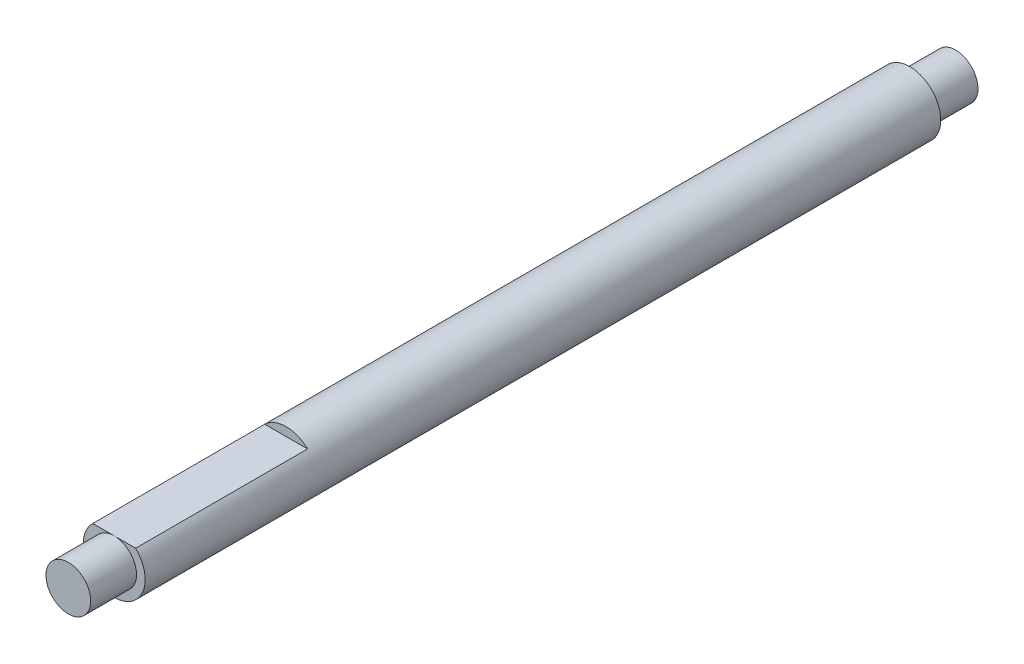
ISO-10303-21;
HEADER;
FILE_DESCRIPTION(('STEP AP214'),'2;1');
FILE_NAME('part.step','',(''),(''),'','','');
FILE_SCHEMA(('AUTOMOTIVE_DESIGN { 1 0 10303 214 1 1 1 1 }'));
ENDSEC;
DATA;
#1=APPLICATION_CONTEXT('core data for automotive mechanical design processes');
#2=APPLICATION_PROTOCOL_DEFINITION('international standard','automotive_design',2000,#1);
#3=PRODUCT_CONTEXT('',#1,'mechanical');
#4=PRODUCT('Part','Part','',(#3));
#5=PRODUCT_RELATED_PRODUCT_CATEGORY('part','',(#4));
#6=PRODUCT_DEFINITION_FORMATION('','',#4);
#7=PRODUCT_DEFINITION_CONTEXT('part definition',#1,'design');
#8=PRODUCT_DEFINITION('design','',#6,#7);
#9=PRODUCT_DEFINITION_SHAPE('','',#8);
#10=(LENGTH_UNIT() NAMED_UNIT(*) SI_UNIT(.MILLI.,.METRE.));
#11=(NAMED_UNIT(*) PLANE_ANGLE_UNIT() SI_UNIT($,.RADIAN.));
#12=(NAMED_UNIT(*) SI_UNIT($,.STERADIAN.) SOLID_ANGLE_UNIT());
#13=UNCERTAINTY_MEASURE_WITH_UNIT(LENGTH_MEASURE(1.E-05),#10,'distance_accuracy_value','');
#14=(GEOMETRIC_REPRESENTATION_CONTEXT(3) GLOBAL_UNCERTAINTY_ASSIGNED_CONTEXT((#13)) GLOBAL_UNIT_ASSIGNED_CONTEXT((#10,
#11,#12)) REPRESENTATION_CONTEXT('',''));
#15=CARTESIAN_POINT('',(0.,0.,0.));
#16=DIRECTION('',(0.,0.,1.));
#17=DIRECTION('',(1.,0.,0.));
#18=AXIS2_PLACEMENT_3D('',#15,#16,#17);
#19=CARTESIAN_POINT('',(0.,0.,0.));
#20=DIRECTION('',(0.,0.,1.));
#21=DIRECTION('',(1.,0.,0.));
#22=AXIS2_PLACEMENT_3D('',#19,#20,#21);
#23=PLANE('',#22);
#24=CARTESIAN_POINT('',(0.,0.,0.));
#25=DIRECTION('',(0.,0.,1.));
#26=DIRECTION('',(1.,0.,0.));
#27=AXIS2_PLACEMENT_3D('',#24,#25,#26);
#28=CIRCLE('',#27,2.7);
#29=CARTESIAN_POINT('',(2.7,0.,0.));
#30=VERTEX_POINT('',#29);
#31=EDGE_CURVE('E79',#30,#30,#28,.T.);
#32=ORIENTED_EDGE('',*,*,#31,.F.);
#33=EDGE_LOOP('',(#32));
#34=FACE_BOUND('',#33,.T.);
#35=CARTESIAN_POINT('',(0.,0.,0.));
#36=DIRECTION('',(0.,0.,1.));
#37=DIRECTION('',(1.,0.,0.));
#38=AXIS2_PLACEMENT_3D('',#35,#36,#37);
#39=CIRCLE('',#38,1.95);
#40=CARTESIAN_POINT('',(1.95,0.,0.));
#41=VERTEX_POINT('',#40);
#42=EDGE_CURVE('E42',#41,#41,#39,.F.);
#43=ORIENTED_EDGE('',*,*,#42,.F.);
#44=EDGE_LOOP('',(#43));
#45=FACE_BOUND('',#44,.T.);
#46=ADVANCED_FACE('F34',(#34,#45),#23,.F.);
#47=CARTESIAN_POINT('',(0.,0.,69.4));
#48=DIRECTION('',(0.,0.,1.));
#49=DIRECTION('',(1.,0.,0.));
#50=AXIS2_PLACEMENT_3D('',#47,#48,#49);
#51=PLANE('',#50);
#52=DIRECTION('',(1.,0.,0.));
#53=VECTOR('',#52,1.);
#54=CARTESIAN_POINT('',(-1.86748493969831,1.95,69.4));
#55=LINE('',#54,#53);
#56=CARTESIAN_POINT('',(-1.86748493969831,1.95,69.4));
#57=VERTEX_POINT('',#56);
#58=CARTESIAN_POINT('',(0.,1.95,69.4));
#59=VERTEX_POINT('',#58);
#60=EDGE_CURVE('E49',#57,#59,#55,.T.);
#61=ORIENTED_EDGE('',*,*,#60,.F.);
#62=CARTESIAN_POINT('',(0.,0.,69.4));
#63=DIRECTION('',(0.,0.,1.));
#64=DIRECTION('',(1.,0.,0.));
#65=AXIS2_PLACEMENT_3D('',#62,#63,#64);
#66=CIRCLE('',#65,2.7);
#67=CARTESIAN_POINT('',(1.86748493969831,1.95,69.4));
#68=VERTEX_POINT('',#67);
#69=EDGE_CURVE('E74',#57,#68,#66,.T.);
#70=ORIENTED_EDGE('',*,*,#69,.T.);
#71=EDGE_CURVE('E62',#59,#68,#55,.T.);
#72=ORIENTED_EDGE('',*,*,#71,.F.);
#73=CARTESIAN_POINT('',(0.,0.,69.4));
#74=DIRECTION('',(0.,0.,1.));
#75=DIRECTION('',(1.,0.,0.));
#76=AXIS2_PLACEMENT_3D('',#73,#74,#75);
#77=CIRCLE('',#76,1.95);
#78=EDGE_CURVE('E86',#59,#59,#77,.T.);
#79=ORIENTED_EDGE('',*,*,#78,.F.);
#80=EDGE_LOOP('',(#61,#70,#72,#79));
#81=FACE_BOUND('',#80,.T.);
#82=ADVANCED_FACE('F78',(#81),#51,.T.);
#83=CARTESIAN_POINT('',(0.,0.,69.4));
#84=DIRECTION('',(0.,0.,-1.));
#85=DIRECTION('',(-1.,0.,0.));
#86=AXIS2_PLACEMENT_3D('',#83,#84,#85);
#87=CYLINDRICAL_SURFACE('',#86,2.7);
#88=CARTESIAN_POINT('',(0.,0.,54.4));
#89=DIRECTION('',(0.,0.,1.));
#90=DIRECTION('',(1.,0.,0.));
#91=AXIS2_PLACEMENT_3D('',#88,#89,#90);
#92=CIRCLE('',#91,2.7);
#93=CARTESIAN_POINT('',(1.86748493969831,1.95,54.4));
#94=VERTEX_POINT('',#93);
#95=CARTESIAN_POINT('',(-1.86748493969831,1.95,54.4));
#96=VERTEX_POINT('',#95);
#97=EDGE_CURVE('E11',#94,#96,#92,.T.);
#98=ORIENTED_EDGE('',*,*,#97,.F.);
#99=DIRECTION('',(0.,0.,1.));
#100=VECTOR('',#99,1.);
#101=CARTESIAN_POINT('',(1.86748493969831,1.95,54.4));
#102=LINE('',#101,#100);
#103=EDGE_CURVE('E65',#94,#68,#102,.T.);
#104=ORIENTED_EDGE('',*,*,#103,.T.);
#105=ORIENTED_EDGE('',*,*,#69,.F.);
#106=DIRECTION('',(0.,0.,1.));
#107=VECTOR('',#106,1.);
#108=CARTESIAN_POINT('',(-1.86748493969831,1.95,54.4));
#109=LINE('',#108,#107);
#110=EDGE_CURVE('E76',#96,#57,#109,.T.);
#111=ORIENTED_EDGE('',*,*,#110,.F.);
#112=EDGE_LOOP('',(#98,#104,#105,#111));
#113=FACE_BOUND('',#112,.T.);
#114=ORIENTED_EDGE('',*,*,#31,.T.);
#115=EDGE_LOOP('',(#114));
#116=FACE_BOUND('',#115,.T.);
#117=ADVANCED_FACE('F36',(#113,#116),#87,.T.);
#118=CARTESIAN_POINT('',(0.,0.,73.4));
#119=DIRECTION('',(0.,0.,-1.));
#120=DIRECTION('',(-1.,0.,0.));
#121=AXIS2_PLACEMENT_3D('',#118,#119,#120);
#122=CYLINDRICAL_SURFACE('',#121,1.95);
#123=CARTESIAN_POINT('',(0.,0.,73.4));
#124=DIRECTION('',(0.,0.,1.));
#125=DIRECTION('',(1.,0.,0.));
#126=AXIS2_PLACEMENT_3D('',#123,#124,#125);
#127=CIRCLE('',#126,1.95);
#128=CARTESIAN_POINT('',(1.95,0.,73.4));
#129=VERTEX_POINT('',#128);
#130=EDGE_CURVE('E83',#129,#129,#127,.T.);
#131=ORIENTED_EDGE('',*,*,#130,.F.);
#132=EDGE_LOOP('',(#131));
#133=FACE_BOUND('',#132,.T.);
#134=ORIENTED_EDGE('',*,*,#78,.T.);
#135=EDGE_LOOP('',(#134));
#136=FACE_BOUND('',#135,.T.);
#137=ADVANCED_FACE('F116',(#133,#136),#122,.T.);
#138=CARTESIAN_POINT('',(0.,0.,73.4));
#139=DIRECTION('',(0.,0.,1.));
#140=DIRECTION('',(1.,0.,0.));
#141=AXIS2_PLACEMENT_3D('',#138,#139,#140);
#142=PLANE('',#141);
#143=ORIENTED_EDGE('',*,*,#130,.T.);
#144=EDGE_LOOP('',(#143));
#145=FACE_BOUND('',#144,.T.);
#146=ADVANCED_FACE('F119',(#145),#142,.T.);
#147=CARTESIAN_POINT('',(0.,0.,-4.));
#148=DIRECTION('',(0.,0.,1.));
#149=DIRECTION('',(1.,0.,0.));
#150=AXIS2_PLACEMENT_3D('',#147,#148,#149);
#151=CYLINDRICAL_SURFACE('',#150,1.95);
#152=CARTESIAN_POINT('',(0.,0.,-4.));
#153=DIRECTION('',(0.,0.,-1.));
#154=DIRECTION('',(-1.,0.,0.));
#155=AXIS2_PLACEMENT_3D('',#152,#153,#154);
#156=CIRCLE('',#155,1.95);
#157=CARTESIAN_POINT('',(-1.95,0.,-4.));
#158=VERTEX_POINT('',#157);
#159=EDGE_CURVE('E75',#158,#158,#156,.T.);
#160=ORIENTED_EDGE('',*,*,#159,.F.);
#161=EDGE_LOOP('',(#160));
#162=FACE_BOUND('',#161,.T.);
#163=ORIENTED_EDGE('',*,*,#42,.T.);
#164=EDGE_LOOP('',(#163));
#165=FACE_BOUND('',#164,.T.);
#166=ADVANCED_FACE('F104',(#162,#165),#151,.T.);
#167=CARTESIAN_POINT('',(0.,0.,-4.));
#168=DIRECTION('',(0.,0.,-1.));
#169=DIRECTION('',(-1.,0.,0.));
#170=AXIS2_PLACEMENT_3D('',#167,#168,#169);
#171=PLANE('',#170);
#172=ORIENTED_EDGE('',*,*,#159,.T.);
#173=EDGE_LOOP('',(#172));
#174=FACE_BOUND('',#173,.T.);
#175=ADVANCED_FACE('F97',(#174),#171,.T.);
#176=CARTESIAN_POINT('',(0.,0.,54.4));
#177=DIRECTION('',(0.,0.,1.));
#178=DIRECTION('',(1.,0.,0.));
#179=AXIS2_PLACEMENT_3D('',#176,#177,#178);
#180=PLANE('',#179);
#181=DIRECTION('',(1.,0.,0.));
#182=VECTOR('',#181,1.);
#183=CARTESIAN_POINT('',(-1.86748493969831,1.95,54.4));
#184=LINE('',#183,#182);
#185=EDGE_CURVE('E92',#96,#94,#184,.T.);
#186=ORIENTED_EDGE('',*,*,#185,.T.);
#187=ORIENTED_EDGE('',*,*,#97,.T.);
#188=EDGE_LOOP('',(#186,#187));
#189=FACE_BOUND('',#188,.T.);
#190=ADVANCED_FACE('F95',(#189),#180,.T.);
#191=CARTESIAN_POINT('',(-1.86748493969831,1.95,54.4));
#192=DIRECTION('',(0.,-1.,0.));
#193=DIRECTION('',(0.,0.,-1.));
#194=AXIS2_PLACEMENT_3D('',#191,#192,#193);
#195=PLANE('',#194);
#196=ORIENTED_EDGE('',*,*,#60,.T.);
#197=ORIENTED_EDGE('',*,*,#71,.T.);
#198=ORIENTED_EDGE('',*,*,#103,.F.);
#199=ORIENTED_EDGE('',*,*,#185,.F.);
#200=ORIENTED_EDGE('',*,*,#110,.T.);
#201=EDGE_LOOP('',(#196,#197,#198,#199,#200));
#202=FACE_BOUND('',#201,.T.);
#203=ADVANCED_FACE('F63',(#202),#195,.F.);
#204=CLOSED_SHELL('',(#46,#82,#117,#137,#146,#166,#175,#190,#203));
#205=MANIFOLD_SOLID_BREP('B2',#204);
#206=ADVANCED_BREP_SHAPE_REPRESENTATION('',(#18,#205),#14);
#207=SHAPE_DEFINITION_REPRESENTATION(#9,#206);
ENDSEC;
END-ISO-10303-21;
